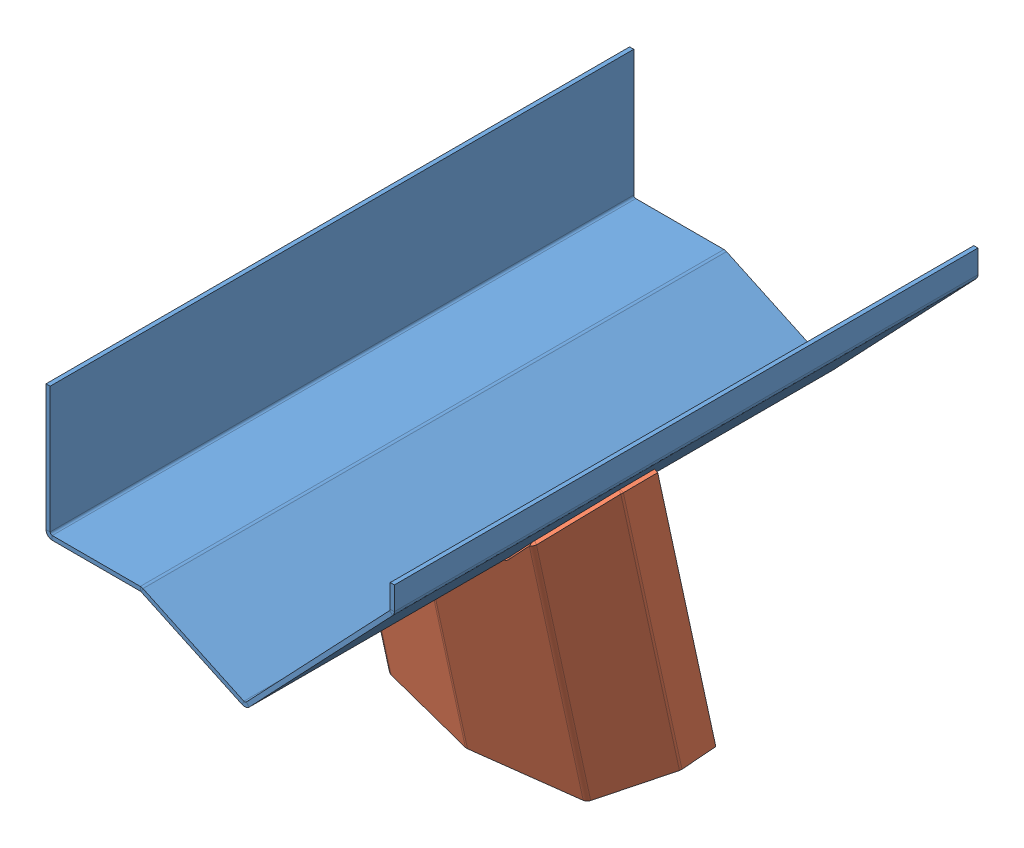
SolidWorks assembly Baugruppe1 SCHNITT tm.SLDASM, configuration Standard (file format 3400). Lengths in mm.
Overall size (168.04 213.87 281.5).
2 component instances, 2 part files, 0 mates.
Components (placement in the parent):
- Teil2 tm-1: Teil2 tm.SLDPRT [Standard] at origin size (168.04 86.97 281.5)
- Teil1 tm-1: Teil1 tm.SLDPRT [Standard] at (3.585 -136.0532 119.2059) x (0.978712 -0.150806 0.139212) z (0.105334 0.951236 0.289923) size (104.08 63.89 153.3)
